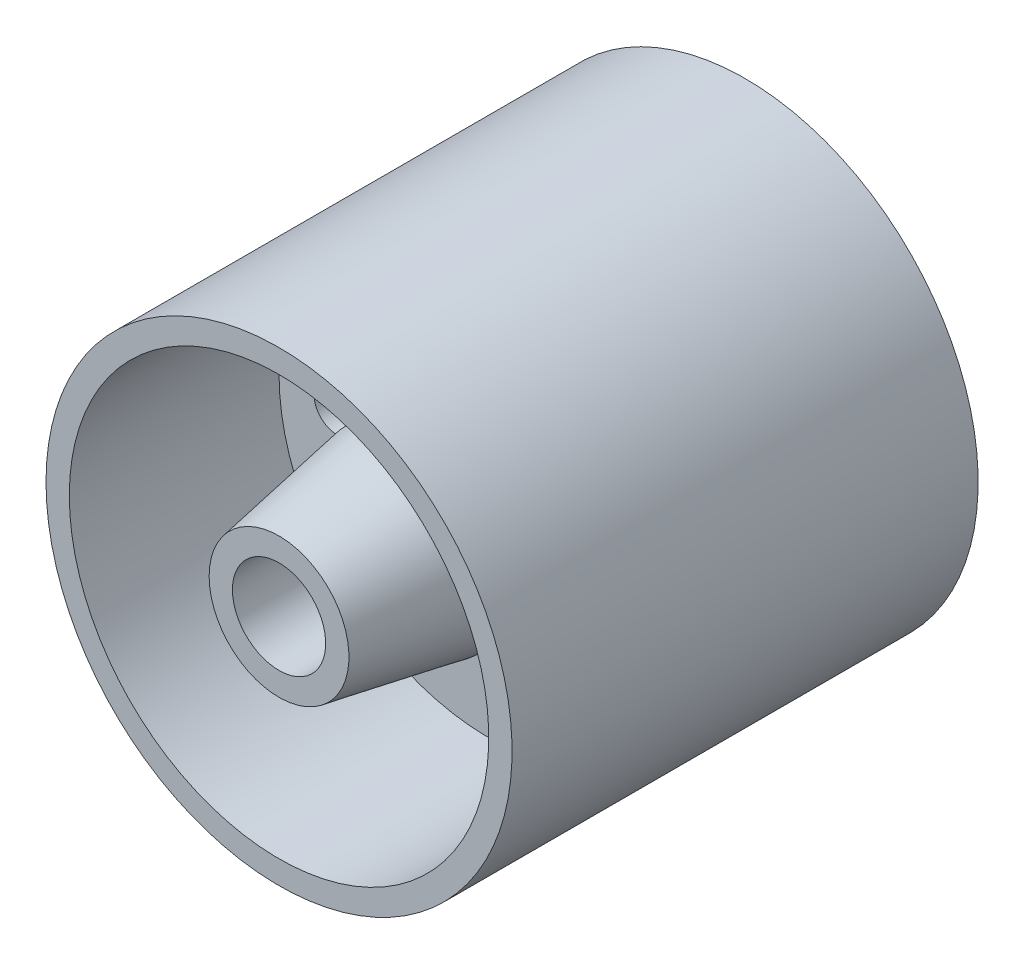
ISO-10303-21;
HEADER;
FILE_DESCRIPTION(('STEP AP214'),'2;1');
FILE_NAME('part.step','',(''),(''),'','','');
FILE_SCHEMA(('AUTOMOTIVE_DESIGN { 1 0 10303 214 1 1 1 1 }'));
ENDSEC;
DATA;
#1=APPLICATION_CONTEXT('core data for automotive mechanical design processes');
#2=APPLICATION_PROTOCOL_DEFINITION('international standard','automotive_design',2000,#1);
#3=PRODUCT_CONTEXT('',#1,'mechanical');
#4=PRODUCT('Part','Part','',(#3));
#5=PRODUCT_RELATED_PRODUCT_CATEGORY('part','',(#4));
#6=PRODUCT_DEFINITION_FORMATION('','',#4);
#7=PRODUCT_DEFINITION_CONTEXT('part definition',#1,'design');
#8=PRODUCT_DEFINITION('design','',#6,#7);
#9=PRODUCT_DEFINITION_SHAPE('','',#8);
#10=(LENGTH_UNIT() NAMED_UNIT(*) SI_UNIT(.MILLI.,.METRE.));
#11=(NAMED_UNIT(*) PLANE_ANGLE_UNIT() SI_UNIT($,.RADIAN.));
#12=(NAMED_UNIT(*) SI_UNIT($,.STERADIAN.) SOLID_ANGLE_UNIT());
#13=UNCERTAINTY_MEASURE_WITH_UNIT(LENGTH_MEASURE(1.E-05),#10,'distance_accuracy_value','');
#14=(GEOMETRIC_REPRESENTATION_CONTEXT(3) GLOBAL_UNCERTAINTY_ASSIGNED_CONTEXT((#13)) GLOBAL_UNIT_ASSIGNED_CONTEXT((#10,
#11,#12)) REPRESENTATION_CONTEXT('',''));
#15=CARTESIAN_POINT('',(0.,0.,0.));
#16=DIRECTION('',(0.,0.,1.));
#17=DIRECTION('',(1.,0.,0.));
#18=AXIS2_PLACEMENT_3D('',#15,#16,#17);
#19=CARTESIAN_POINT('',(0.,0.,0.));
#20=DIRECTION('',(0.,0.,-1.));
#21=DIRECTION('',(-1.,0.,0.));
#22=AXIS2_PLACEMENT_3D('',#19,#20,#21);
#23=CYLINDRICAL_SURFACE('',#22,50.);
#24=CARTESIAN_POINT('',(0.,0.,50.));
#25=DIRECTION('',(0.,0.,-1.));
#26=DIRECTION('',(-1.,0.,0.));
#27=AXIS2_PLACEMENT_3D('',#24,#25,#26);
#28=CIRCLE('',#27,50.);
#29=CARTESIAN_POINT('',(-50.,0.,50.));
#30=VERTEX_POINT('',#29);
#31=EDGE_CURVE('E10',#30,#30,#28,.T.);
#32=ORIENTED_EDGE('',*,*,#31,.T.);
#33=EDGE_LOOP('',(#32));
#34=FACE_BOUND('',#33,.T.);
#35=CARTESIAN_POINT('',(0.,0.,-50.));
#36=DIRECTION('',(0.,0.,-1.));
#37=DIRECTION('',(-1.,0.,0.));
#38=AXIS2_PLACEMENT_3D('',#35,#36,#37);
#39=CIRCLE('',#38,50.);
#40=CARTESIAN_POINT('',(-50.,0.,-50.));
#41=VERTEX_POINT('',#40);
#42=EDGE_CURVE('E59',#41,#41,#39,.T.);
#43=ORIENTED_EDGE('',*,*,#42,.F.);
#44=EDGE_LOOP('',(#43));
#45=FACE_BOUND('',#44,.T.);
#46=ADVANCED_FACE('F31',(#34,#45),#23,.T.);
#47=CARTESIAN_POINT('',(0.,45.,50.));
#48=DIRECTION('',(0.,0.,1.));
#49=DIRECTION('',(1.,0.,0.));
#50=AXIS2_PLACEMENT_3D('',#47,#48,#49);
#51=PLANE('',#50);
#52=CARTESIAN_POINT('',(0.,0.,50.));
#53=DIRECTION('',(0.,0.,-1.));
#54=DIRECTION('',(-1.,0.,0.));
#55=AXIS2_PLACEMENT_3D('',#52,#53,#54);
#56=CIRCLE('',#55,45.);
#57=CARTESIAN_POINT('',(-45.,0.,50.));
#58=VERTEX_POINT('',#57);
#59=EDGE_CURVE('E37',#58,#58,#56,.T.);
#60=ORIENTED_EDGE('',*,*,#59,.T.);
#61=EDGE_LOOP('',(#60));
#62=FACE_BOUND('',#61,.T.);
#63=ORIENTED_EDGE('',*,*,#31,.F.);
#64=EDGE_LOOP('',(#63));
#65=FACE_BOUND('',#64,.T.);
#66=ADVANCED_FACE('F142',(#62,#65),#51,.T.);
#67=CARTESIAN_POINT('',(0.,0.,0.));
#68=DIRECTION('',(0.,0.,-1.));
#69=DIRECTION('',(-1.,0.,0.));
#70=AXIS2_PLACEMENT_3D('',#67,#68,#69);
#71=CYLINDRICAL_SURFACE('',#70,45.);
#72=CARTESIAN_POINT('',(0.,0.,5.));
#73=DIRECTION('',(0.,0.,-1.));
#74=DIRECTION('',(-1.,0.,0.));
#75=AXIS2_PLACEMENT_3D('',#72,#73,#74);
#76=CIRCLE('',#75,45.);
#77=CARTESIAN_POINT('',(-45.,0.,5.));
#78=VERTEX_POINT('',#77);
#79=EDGE_CURVE('E41',#78,#78,#76,.T.);
#80=ORIENTED_EDGE('',*,*,#79,.T.);
#81=EDGE_LOOP('',(#80));
#82=FACE_BOUND('',#81,.T.);
#83=ORIENTED_EDGE('',*,*,#59,.F.);
#84=EDGE_LOOP('',(#83));
#85=FACE_BOUND('',#84,.T.);
#86=ADVANCED_FACE('F124',(#82,#85),#71,.F.);
#87=CARTESIAN_POINT('',(0.,20.,5.));
#88=DIRECTION('',(0.,0.,1.));
#89=DIRECTION('',(1.,0.,0.));
#90=AXIS2_PLACEMENT_3D('',#87,#88,#89);
#91=PLANE('',#90);
#92=CARTESIAN_POINT('',(16.2500000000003,28.1458256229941,5.));
#93=DIRECTION('',(0.,0.,1.));
#94=DIRECTION('',(1.,0.,0.));
#95=AXIS2_PLACEMENT_3D('',#92,#93,#94);
#96=CIRCLE('',#95,4.99999999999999);
#97=CARTESIAN_POINT('',(21.2500000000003,28.1458256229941,5.));
#98=VERTEX_POINT('',#97);
#99=EDGE_CURVE('E113',#98,#98,#96,.T.);
#100=ORIENTED_EDGE('',*,*,#99,.F.);
#101=EDGE_LOOP('',(#100));
#102=FACE_BOUND('',#101,.T.);
#103=CARTESIAN_POINT('',(-16.2499999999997,28.1458256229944,5.));
#104=DIRECTION('',(0.,0.,1.));
#105=DIRECTION('',(1.,0.,0.));
#106=AXIS2_PLACEMENT_3D('',#103,#104,#105);
#107=CIRCLE('',#106,4.99999999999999);
#108=CARTESIAN_POINT('',(-11.2499999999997,28.1458256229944,5.));
#109=VERTEX_POINT('',#108);
#110=EDGE_CURVE('E107',#109,#109,#107,.T.);
#111=ORIENTED_EDGE('',*,*,#110,.F.);
#112=EDGE_LOOP('',(#111));
#113=FACE_BOUND('',#112,.T.);
#114=CARTESIAN_POINT('',(-32.5,2.2694641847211E-13,5.));
#115=DIRECTION('',(0.,0.,1.));
#116=DIRECTION('',(1.,0.,0.));
#117=AXIS2_PLACEMENT_3D('',#114,#115,#116);
#118=CIRCLE('',#117,4.99999999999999);
#119=CARTESIAN_POINT('',(-27.5,2.2694641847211E-13,5.));
#120=VERTEX_POINT('',#119);
#121=EDGE_CURVE('E101',#120,#120,#118,.T.);
#122=ORIENTED_EDGE('',*,*,#121,.F.);
#123=EDGE_LOOP('',(#122));
#124=FACE_BOUND('',#123,.T.);
#125=CARTESIAN_POINT('',(-16.2500000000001,-28.1458256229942,5.));
#126=DIRECTION('',(0.,0.,1.));
#127=DIRECTION('',(1.,0.,0.));
#128=AXIS2_PLACEMENT_3D('',#125,#126,#127);
#129=CIRCLE('',#128,4.99999999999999);
#130=CARTESIAN_POINT('',(-11.2500000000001,-28.1458256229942,5.));
#131=VERTEX_POINT('',#130);
#132=EDGE_CURVE('E95',#131,#131,#129,.T.);
#133=ORIENTED_EDGE('',*,*,#132,.F.);
#134=EDGE_LOOP('',(#133));
#135=FACE_BOUND('',#134,.T.);
#136=CARTESIAN_POINT('',(16.2499999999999,-28.1458256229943,5.));
#137=DIRECTION('',(0.,0.,1.));
#138=DIRECTION('',(1.,0.,0.));
#139=AXIS2_PLACEMENT_3D('',#136,#137,#138);
#140=CIRCLE('',#139,4.99999999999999);
#141=CARTESIAN_POINT('',(21.2499999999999,-28.1458256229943,5.));
#142=VERTEX_POINT('',#141);
#143=EDGE_CURVE('E89',#142,#142,#140,.T.);
#144=ORIENTED_EDGE('',*,*,#143,.F.);
#145=EDGE_LOOP('',(#144));
#146=FACE_BOUND('',#145,.T.);
#147=CARTESIAN_POINT('',(32.5,0.,5.));
#148=DIRECTION('',(0.,0.,1.));
#149=DIRECTION('',(1.,0.,0.));
#150=AXIS2_PLACEMENT_3D('',#147,#148,#149);
#151=CIRCLE('',#150,4.99999999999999);
#152=CARTESIAN_POINT('',(37.5,0.,5.));
#153=VERTEX_POINT('',#152);
#154=EDGE_CURVE('E83',#153,#153,#151,.T.);
#155=ORIENTED_EDGE('',*,*,#154,.F.);
#156=EDGE_LOOP('',(#155));
#157=FACE_BOUND('',#156,.T.);
#158=CARTESIAN_POINT('',(0.,0.,5.));
#159=DIRECTION('',(0.,0.,-1.));
#160=DIRECTION('',(-1.,0.,0.));
#161=AXIS2_PLACEMENT_3D('',#158,#159,#160);
#162=CIRCLE('',#161,20.);
#163=CARTESIAN_POINT('',(-20.,0.,5.));
#164=VERTEX_POINT('',#163);
#165=EDGE_CURVE('E45',#164,#164,#162,.T.);
#166=ORIENTED_EDGE('',*,*,#165,.T.);
#167=EDGE_LOOP('',(#166));
#168=FACE_BOUND('',#167,.T.);
#169=ORIENTED_EDGE('',*,*,#79,.F.);
#170=EDGE_LOOP('',(#169));
#171=FACE_BOUND('',#170,.T.);
#172=ADVANCED_FACE('F120',(#102,#113,#124,#135,#146,#157,#168,#171),#91,.T.);
#173=CARTESIAN_POINT('',(0.,0.,0.));
#174=DIRECTION('',(0.,0.,-1.));
#175=DIRECTION('',(-1.,0.,0.));
#176=AXIS2_PLACEMENT_3D('',#173,#174,#175);
#177=CYLINDRICAL_SURFACE('',#176,20.);
#178=CARTESIAN_POINT('',(0.,0.,21.6435909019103));
#179=DIRECTION('',(0.,0.,-1.));
#180=DIRECTION('',(-1.,0.,0.));
#181=AXIS2_PLACEMENT_3D('',#178,#179,#180);
#182=CIRCLE('',#181,20.);
#183=CARTESIAN_POINT('',(-20.,0.,21.6435909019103));
#184=VERTEX_POINT('',#183);
#185=EDGE_CURVE('E50',#184,#184,#182,.T.);
#186=ORIENTED_EDGE('',*,*,#185,.T.);
#187=EDGE_LOOP('',(#186));
#188=FACE_BOUND('',#187,.T.);
#189=ORIENTED_EDGE('',*,*,#165,.F.);
#190=EDGE_LOOP('',(#189));
#191=FACE_BOUND('',#190,.T.);
#192=ADVANCED_FACE('F123',(#188,#191),#177,.T.);
#193=CARTESIAN_POINT('',(0.,0.,21.6435909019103));
#194=DIRECTION('',(0.,0.,-1.));
#195=DIRECTION('',(-1.,0.,0.));
#196=AXIS2_PLACEMENT_3D('',#193,#194,#195);
#197=CONICAL_SURFACE('',#196,20.,0.174532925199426);
#198=CARTESIAN_POINT('',(0.,0.,50.));
#199=DIRECTION('',(0.,0.,-1.));
#200=DIRECTION('',(-1.,0.,0.));
#201=AXIS2_PLACEMENT_3D('',#198,#199,#200);
#202=CIRCLE('',#201,15.);
#203=CARTESIAN_POINT('',(-15.,0.,50.));
#204=VERTEX_POINT('',#203);
#205=EDGE_CURVE('E53',#204,#204,#202,.T.);
#206=ORIENTED_EDGE('',*,*,#205,.T.);
#207=EDGE_LOOP('',(#206));
#208=FACE_BOUND('',#207,.T.);
#209=ORIENTED_EDGE('',*,*,#185,.F.);
#210=EDGE_LOOP('',(#209));
#211=FACE_BOUND('',#210,.T.);
#212=ADVANCED_FACE('F174',(#208,#211),#197,.T.);
#213=CARTESIAN_POINT('',(0.,9.99999999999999,50.));
#214=DIRECTION('',(0.,0.,1.));
#215=DIRECTION('',(1.,0.,0.));
#216=AXIS2_PLACEMENT_3D('',#213,#214,#215);
#217=PLANE('',#216);
#218=CARTESIAN_POINT('',(0.,0.,50.));
#219=DIRECTION('',(0.,0.,-1.));
#220=DIRECTION('',(-1.,0.,0.));
#221=AXIS2_PLACEMENT_3D('',#218,#219,#220);
#222=CIRCLE('',#221,9.99999999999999);
#223=CARTESIAN_POINT('',(-9.99999999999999,0.,50.));
#224=VERTEX_POINT('',#223);
#225=EDGE_CURVE('E56',#224,#224,#222,.T.);
#226=ORIENTED_EDGE('',*,*,#225,.T.);
#227=EDGE_LOOP('',(#226));
#228=FACE_BOUND('',#227,.T.);
#229=ORIENTED_EDGE('',*,*,#205,.F.);
#230=EDGE_LOOP('',(#229));
#231=FACE_BOUND('',#230,.T.);
#232=ADVANCED_FACE('F166',(#228,#231),#217,.T.);
#233=CARTESIAN_POINT('',(0.,0.,0.));
#234=DIRECTION('',(0.,0.,-1.));
#235=DIRECTION('',(-1.,0.,0.));
#236=AXIS2_PLACEMENT_3D('',#233,#234,#235);
#237=CYLINDRICAL_SURFACE('',#236,10.);
#238=ORIENTED_EDGE('',*,*,#225,.F.);
#239=EDGE_LOOP('',(#238));
#240=FACE_BOUND('',#239,.T.);
#241=CARTESIAN_POINT('',(0.,0.,-50.));
#242=DIRECTION('',(0.,0.,-1.));
#243=DIRECTION('',(-1.,0.,0.));
#244=AXIS2_PLACEMENT_3D('',#241,#242,#243);
#245=CIRCLE('',#244,9.99999999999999);
#246=CARTESIAN_POINT('',(-9.99999999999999,0.,-50.));
#247=VERTEX_POINT('',#246);
#248=EDGE_CURVE('E77',#247,#247,#245,.T.);
#249=ORIENTED_EDGE('',*,*,#248,.T.);
#250=EDGE_LOOP('',(#249));
#251=FACE_BOUND('',#250,.T.);
#252=ADVANCED_FACE('F156',(#240,#251),#237,.F.);
#253=CARTESIAN_POINT('',(0.,45.,-50.));
#254=DIRECTION('',(0.,0.,-1.));
#255=DIRECTION('',(1.,0.,0.));
#256=AXIS2_PLACEMENT_3D('',#253,#254,#255);
#257=PLANE('',#256);
#258=CARTESIAN_POINT('',(0.,0.,-50.));
#259=DIRECTION('',(0.,0.,-1.));
#260=DIRECTION('',(-1.,0.,0.));
#261=AXIS2_PLACEMENT_3D('',#258,#259,#260);
#262=CIRCLE('',#261,45.);
#263=CARTESIAN_POINT('',(-45.,0.,-50.));
#264=VERTEX_POINT('',#263);
#265=EDGE_CURVE('E62',#264,#264,#262,.T.);
#266=ORIENTED_EDGE('',*,*,#265,.F.);
#267=EDGE_LOOP('',(#266));
#268=FACE_BOUND('',#267,.T.);
#269=ORIENTED_EDGE('',*,*,#42,.T.);
#270=EDGE_LOOP('',(#269));
#271=FACE_BOUND('',#270,.T.);
#272=ADVANCED_FACE('F153',(#268,#271),#257,.T.);
#273=CARTESIAN_POINT('',(0.,0.,0.));
#274=DIRECTION('',(0.,0.,1.));
#275=DIRECTION('',(-1.,0.,0.));
#276=AXIS2_PLACEMENT_3D('',#273,#274,#275);
#277=CYLINDRICAL_SURFACE('',#276,45.);
#278=CARTESIAN_POINT('',(0.,0.,-5.));
#279=DIRECTION('',(0.,0.,-1.));
#280=DIRECTION('',(-1.,0.,0.));
#281=AXIS2_PLACEMENT_3D('',#278,#279,#280);
#282=CIRCLE('',#281,45.);
#283=CARTESIAN_POINT('',(-45.,0.,-5.));
#284=VERTEX_POINT('',#283);
#285=EDGE_CURVE('E65',#284,#284,#282,.T.);
#286=ORIENTED_EDGE('',*,*,#285,.F.);
#287=EDGE_LOOP('',(#286));
#288=FACE_BOUND('',#287,.T.);
#289=ORIENTED_EDGE('',*,*,#265,.T.);
#290=EDGE_LOOP('',(#289));
#291=FACE_BOUND('',#290,.T.);
#292=ADVANCED_FACE('F155',(#288,#291),#277,.F.);
#293=CARTESIAN_POINT('',(0.,20.,-5.));
#294=DIRECTION('',(0.,0.,-1.));
#295=DIRECTION('',(1.,0.,0.));
#296=AXIS2_PLACEMENT_3D('',#293,#294,#295);
#297=PLANE('',#296);
#298=CARTESIAN_POINT('',(16.2500000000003,28.1458256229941,-5.));
#299=DIRECTION('',(0.,0.,-1.));
#300=DIRECTION('',(-1.,0.,0.));
#301=AXIS2_PLACEMENT_3D('',#298,#299,#300);
#302=CIRCLE('',#301,4.99999999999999);
#303=CARTESIAN_POINT('',(11.2500000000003,28.1458256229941,-5.));
#304=VERTEX_POINT('',#303);
#305=EDGE_CURVE('E110',#304,#304,#302,.T.);
#306=ORIENTED_EDGE('',*,*,#305,.F.);
#307=EDGE_LOOP('',(#306));
#308=FACE_BOUND('',#307,.T.);
#309=CARTESIAN_POINT('',(-16.2499999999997,28.1458256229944,-5.));
#310=DIRECTION('',(0.,0.,-1.));
#311=DIRECTION('',(-1.,0.,0.));
#312=AXIS2_PLACEMENT_3D('',#309,#310,#311);
#313=CIRCLE('',#312,4.99999999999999);
#314=CARTESIAN_POINT('',(-21.2499999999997,28.1458256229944,-5.));
#315=VERTEX_POINT('',#314);
#316=EDGE_CURVE('E104',#315,#315,#313,.T.);
#317=ORIENTED_EDGE('',*,*,#316,.F.);
#318=EDGE_LOOP('',(#317));
#319=FACE_BOUND('',#318,.T.);
#320=CARTESIAN_POINT('',(-32.5,2.2694641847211E-13,-5.));
#321=DIRECTION('',(0.,0.,-1.));
#322=DIRECTION('',(-1.,0.,0.));
#323=AXIS2_PLACEMENT_3D('',#320,#321,#322);
#324=CIRCLE('',#323,4.99999999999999);
#325=CARTESIAN_POINT('',(-37.5,2.2694641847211E-13,-5.));
#326=VERTEX_POINT('',#325);
#327=EDGE_CURVE('E98',#326,#326,#324,.T.);
#328=ORIENTED_EDGE('',*,*,#327,.F.);
#329=EDGE_LOOP('',(#328));
#330=FACE_BOUND('',#329,.T.);
#331=CARTESIAN_POINT('',(-16.2500000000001,-28.1458256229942,-5.));
#332=DIRECTION('',(0.,0.,-1.));
#333=DIRECTION('',(-1.,0.,0.));
#334=AXIS2_PLACEMENT_3D('',#331,#332,#333);
#335=CIRCLE('',#334,4.99999999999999);
#336=CARTESIAN_POINT('',(-21.2500000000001,-28.1458256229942,-5.));
#337=VERTEX_POINT('',#336);
#338=EDGE_CURVE('E92',#337,#337,#335,.T.);
#339=ORIENTED_EDGE('',*,*,#338,.F.);
#340=EDGE_LOOP('',(#339));
#341=FACE_BOUND('',#340,.T.);
#342=CARTESIAN_POINT('',(16.2499999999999,-28.1458256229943,-5.));
#343=DIRECTION('',(0.,0.,-1.));
#344=DIRECTION('',(-1.,0.,0.));
#345=AXIS2_PLACEMENT_3D('',#342,#343,#344);
#346=CIRCLE('',#345,4.99999999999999);
#347=CARTESIAN_POINT('',(11.2499999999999,-28.1458256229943,-5.));
#348=VERTEX_POINT('',#347);
#349=EDGE_CURVE('E86',#348,#348,#346,.T.);
#350=ORIENTED_EDGE('',*,*,#349,.F.);
#351=EDGE_LOOP('',(#350));
#352=FACE_BOUND('',#351,.T.);
#353=CARTESIAN_POINT('',(32.5,0.,-5.));
#354=DIRECTION('',(0.,0.,-1.));
#355=DIRECTION('',(-1.,0.,0.));
#356=AXIS2_PLACEMENT_3D('',#353,#354,#355);
#357=CIRCLE('',#356,4.99999999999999);
#358=CARTESIAN_POINT('',(27.5,0.,-5.));
#359=VERTEX_POINT('',#358);
#360=EDGE_CURVE('E80',#359,#359,#357,.T.);
#361=ORIENTED_EDGE('',*,*,#360,.F.);
#362=EDGE_LOOP('',(#361));
#363=FACE_BOUND('',#362,.T.);
#364=CARTESIAN_POINT('',(0.,0.,-5.));
#365=DIRECTION('',(0.,0.,-1.));
#366=DIRECTION('',(-1.,0.,0.));
#367=AXIS2_PLACEMENT_3D('',#364,#365,#366);
#368=CIRCLE('',#367,20.);
#369=CARTESIAN_POINT('',(-20.,0.,-5.));
#370=VERTEX_POINT('',#369);
#371=EDGE_CURVE('E68',#370,#370,#368,.T.);
#372=ORIENTED_EDGE('',*,*,#371,.F.);
#373=EDGE_LOOP('',(#372));
#374=FACE_BOUND('',#373,.T.);
#375=ORIENTED_EDGE('',*,*,#285,.T.);
#376=EDGE_LOOP('',(#375));
#377=FACE_BOUND('',#376,.T.);
#378=ADVANCED_FACE('F163',(#308,#319,#330,#341,#352,#363,#374,#377),#297,.T.);
#379=CARTESIAN_POINT('',(0.,0.,0.));
#380=DIRECTION('',(0.,0.,1.));
#381=DIRECTION('',(-1.,0.,0.));
#382=AXIS2_PLACEMENT_3D('',#379,#380,#381);
#383=CYLINDRICAL_SURFACE('',#382,20.);
#384=CARTESIAN_POINT('',(0.,0.,-21.6435909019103));
#385=DIRECTION('',(0.,0.,-1.));
#386=DIRECTION('',(-1.,0.,0.));
#387=AXIS2_PLACEMENT_3D('',#384,#385,#386);
#388=CIRCLE('',#387,20.);
#389=CARTESIAN_POINT('',(-20.,0.,-21.6435909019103));
#390=VERTEX_POINT('',#389);
#391=EDGE_CURVE('E71',#390,#390,#388,.T.);
#392=ORIENTED_EDGE('',*,*,#391,.F.);
#393=EDGE_LOOP('',(#392));
#394=FACE_BOUND('',#393,.T.);
#395=ORIENTED_EDGE('',*,*,#371,.T.);
#396=EDGE_LOOP('',(#395));
#397=FACE_BOUND('',#396,.T.);
#398=ADVANCED_FACE('F224',(#394,#397),#383,.T.);
#399=CARTESIAN_POINT('',(0.,0.,-21.6435909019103));
#400=DIRECTION('',(0.,0.,1.));
#401=DIRECTION('',(-1.,0.,0.));
#402=AXIS2_PLACEMENT_3D('',#399,#400,#401);
#403=CONICAL_SURFACE('',#402,20.,0.174532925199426);
#404=CARTESIAN_POINT('',(0.,0.,-50.));
#405=DIRECTION('',(0.,0.,-1.));
#406=DIRECTION('',(-1.,0.,0.));
#407=AXIS2_PLACEMENT_3D('',#404,#405,#406);
#408=CIRCLE('',#407,15.);
#409=CARTESIAN_POINT('',(-15.,0.,-50.));
#410=VERTEX_POINT('',#409);
#411=EDGE_CURVE('E74',#410,#410,#408,.T.);
#412=ORIENTED_EDGE('',*,*,#411,.F.);
#413=EDGE_LOOP('',(#412));
#414=FACE_BOUND('',#413,.T.);
#415=ORIENTED_EDGE('',*,*,#391,.T.);
#416=EDGE_LOOP('',(#415));
#417=FACE_BOUND('',#416,.T.);
#418=ADVANCED_FACE('F229',(#414,#417),#403,.T.);
#419=CARTESIAN_POINT('',(0.,9.99999999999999,-50.));
#420=DIRECTION('',(0.,0.,-1.));
#421=DIRECTION('',(1.,0.,0.));
#422=AXIS2_PLACEMENT_3D('',#419,#420,#421);
#423=PLANE('',#422);
#424=ORIENTED_EDGE('',*,*,#248,.F.);
#425=EDGE_LOOP('',(#424));
#426=FACE_BOUND('',#425,.T.);
#427=ORIENTED_EDGE('',*,*,#411,.T.);
#428=EDGE_LOOP('',(#427));
#429=FACE_BOUND('',#428,.T.);
#430=ADVANCED_FACE('F239',(#426,#429),#423,.T.);
#431=CARTESIAN_POINT('',(32.5,0.,5.));
#432=DIRECTION('',(0.,0.,1.));
#433=DIRECTION('',(1.,0.,0.));
#434=AXIS2_PLACEMENT_3D('',#431,#432,#433);
#435=CYLINDRICAL_SURFACE('',#434,4.99999999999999);
#436=ORIENTED_EDGE('',*,*,#154,.T.);
#437=EDGE_LOOP('',(#436));
#438=FACE_BOUND('',#437,.T.);
#439=ORIENTED_EDGE('',*,*,#360,.T.);
#440=EDGE_LOOP('',(#439));
#441=FACE_BOUND('',#440,.T.);
#442=ADVANCED_FACE('F249',(#438,#441),#435,.F.);
#443=CARTESIAN_POINT('',(16.2499999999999,-28.1458256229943,5.));
#444=DIRECTION('',(0.,0.,1.));
#445=DIRECTION('',(1.,0.,0.));
#446=AXIS2_PLACEMENT_3D('',#443,#444,#445);
#447=CYLINDRICAL_SURFACE('',#446,4.99999999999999);
#448=ORIENTED_EDGE('',*,*,#143,.T.);
#449=EDGE_LOOP('',(#448));
#450=FACE_BOUND('',#449,.T.);
#451=ORIENTED_EDGE('',*,*,#349,.T.);
#452=EDGE_LOOP('',(#451));
#453=FACE_BOUND('',#452,.T.);
#454=ADVANCED_FACE('F258',(#450,#453),#447,.F.);
#455=CARTESIAN_POINT('',(-16.2500000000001,-28.1458256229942,5.));
#456=DIRECTION('',(0.,0.,1.));
#457=DIRECTION('',(1.,0.,0.));
#458=AXIS2_PLACEMENT_3D('',#455,#456,#457);
#459=CYLINDRICAL_SURFACE('',#458,4.99999999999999);
#460=ORIENTED_EDGE('',*,*,#132,.T.);
#461=EDGE_LOOP('',(#460));
#462=FACE_BOUND('',#461,.T.);
#463=ORIENTED_EDGE('',*,*,#338,.T.);
#464=EDGE_LOOP('',(#463));
#465=FACE_BOUND('',#464,.T.);
#466=ADVANCED_FACE('F278',(#462,#465),#459,.F.);
#467=CARTESIAN_POINT('',(-32.5,2.2694641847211E-13,5.));
#468=DIRECTION('',(0.,0.,1.));
#469=DIRECTION('',(1.,0.,0.));
#470=AXIS2_PLACEMENT_3D('',#467,#468,#469);
#471=CYLINDRICAL_SURFACE('',#470,4.99999999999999);
#472=ORIENTED_EDGE('',*,*,#121,.T.);
#473=EDGE_LOOP('',(#472));
#474=FACE_BOUND('',#473,.T.);
#475=ORIENTED_EDGE('',*,*,#327,.T.);
#476=EDGE_LOOP('',(#475));
#477=FACE_BOUND('',#476,.T.);
#478=ADVANCED_FACE('F288',(#474,#477),#471,.F.);
#479=CARTESIAN_POINT('',(-16.2499999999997,28.1458256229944,5.));
#480=DIRECTION('',(0.,0.,1.));
#481=DIRECTION('',(1.,0.,0.));
#482=AXIS2_PLACEMENT_3D('',#479,#480,#481);
#483=CYLINDRICAL_SURFACE('',#482,4.99999999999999);
#484=ORIENTED_EDGE('',*,*,#110,.T.);
#485=EDGE_LOOP('',(#484));
#486=FACE_BOUND('',#485,.T.);
#487=ORIENTED_EDGE('',*,*,#316,.T.);
#488=EDGE_LOOP('',(#487));
#489=FACE_BOUND('',#488,.T.);
#490=ADVANCED_FACE('F298',(#486,#489),#483,.F.);
#491=CARTESIAN_POINT('',(16.2500000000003,28.1458256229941,5.));
#492=DIRECTION('',(0.,0.,1.));
#493=DIRECTION('',(1.,0.,0.));
#494=AXIS2_PLACEMENT_3D('',#491,#492,#493);
#495=CYLINDRICAL_SURFACE('',#494,4.99999999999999);
#496=ORIENTED_EDGE('',*,*,#99,.T.);
#497=EDGE_LOOP('',(#496));
#498=FACE_BOUND('',#497,.T.);
#499=ORIENTED_EDGE('',*,*,#305,.T.);
#500=EDGE_LOOP('',(#499));
#501=FACE_BOUND('',#500,.T.);
#502=ADVANCED_FACE('F117',(#498,#501),#495,.F.);
#503=CLOSED_SHELL('',(#46,#66,#86,#172,#192,#212,#232,#252,#272,#292,#378,#398,#418,#430,#442,
#454,#466,#478,#490,#502));
#504=MANIFOLD_SOLID_BREP('B2',#503);
#505=ADVANCED_BREP_SHAPE_REPRESENTATION('',(#18,#504),#14);
#506=SHAPE_DEFINITION_REPRESENTATION(#9,#505);
ENDSEC;
END-ISO-10303-21;
